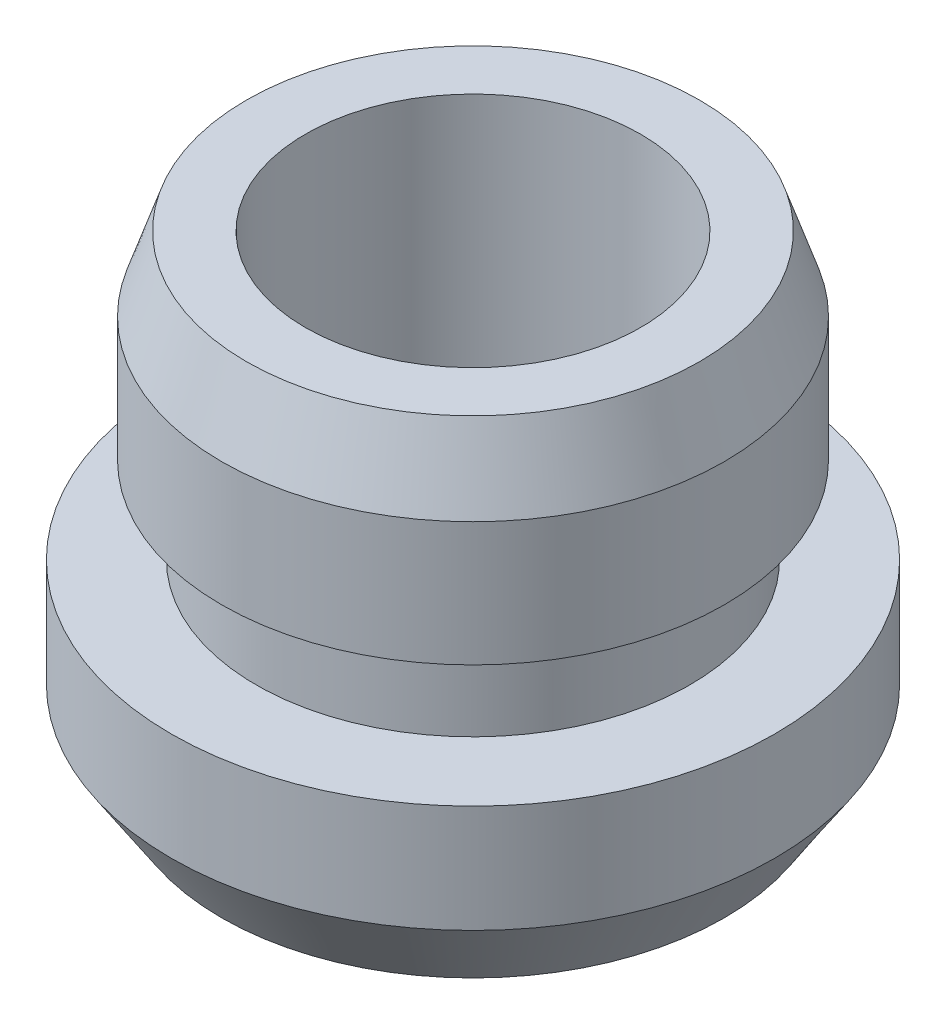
ISO-10303-21;
HEADER;
FILE_DESCRIPTION(('STEP AP214'),'2;1');
FILE_NAME('part.step','',(''),(''),'','','');
FILE_SCHEMA(('AUTOMOTIVE_DESIGN { 1 0 10303 214 1 1 1 1 }'));
ENDSEC;
DATA;
#1=APPLICATION_CONTEXT('core data for automotive mechanical design processes');
#2=APPLICATION_PROTOCOL_DEFINITION('international standard','automotive_design',2000,#1);
#3=PRODUCT_CONTEXT('',#1,'mechanical');
#4=PRODUCT('Part','Part','',(#3));
#5=PRODUCT_RELATED_PRODUCT_CATEGORY('part','',(#4));
#6=PRODUCT_DEFINITION_FORMATION('','',#4);
#7=PRODUCT_DEFINITION_CONTEXT('part definition',#1,'design');
#8=PRODUCT_DEFINITION('design','',#6,#7);
#9=PRODUCT_DEFINITION_SHAPE('','',#8);
#10=(LENGTH_UNIT() NAMED_UNIT(*) SI_UNIT(.MILLI.,.METRE.));
#11=(NAMED_UNIT(*) PLANE_ANGLE_UNIT() SI_UNIT($,.RADIAN.));
#12=(NAMED_UNIT(*) SI_UNIT($,.STERADIAN.) SOLID_ANGLE_UNIT());
#13=UNCERTAINTY_MEASURE_WITH_UNIT(LENGTH_MEASURE(1.E-05),#10,'distance_accuracy_value','');
#14=(GEOMETRIC_REPRESENTATION_CONTEXT(3) GLOBAL_UNCERTAINTY_ASSIGNED_CONTEXT((#13)) GLOBAL_UNIT_ASSIGNED_CONTEXT((#10,
#11,#12)) REPRESENTATION_CONTEXT('',''));
#15=CARTESIAN_POINT('',(0.,0.,0.));
#16=DIRECTION('',(0.,0.,1.));
#17=DIRECTION('',(1.,0.,0.));
#18=AXIS2_PLACEMENT_3D('',#15,#16,#17);
#19=CARTESIAN_POINT('',(0.,2.28857833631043,0.));
#20=DIRECTION('',(0.,1.,0.));
#21=DIRECTION('',(0.,0.,1.));
#22=AXIS2_PLACEMENT_3D('',#19,#20,#21);
#23=CONICAL_SURFACE('',#22,9.,0.580182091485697);
#24=CARTESIAN_POINT('',(0.,0.,0.));
#25=DIRECTION('',(0.,-1.,0.));
#26=DIRECTION('',(0.,0.,-1.));
#27=AXIS2_PLACEMENT_3D('',#24,#25,#26);
#28=CIRCLE('',#27,7.5);
#29=CARTESIAN_POINT('',(0.,0.,-7.5));
#30=VERTEX_POINT('',#29);
#31=EDGE_CURVE('E10',#30,#30,#28,.T.);
#32=ORIENTED_EDGE('',*,*,#31,.F.);
#33=EDGE_LOOP('',(#32));
#34=FACE_BOUND('',#33,.T.);
#35=CARTESIAN_POINT('',(0.,2.28857833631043,0.));
#36=DIRECTION('',(0.,-1.,0.));
#37=DIRECTION('',(0.,0.,-1.));
#38=AXIS2_PLACEMENT_3D('',#35,#36,#37);
#39=CIRCLE('',#38,9.);
#40=CARTESIAN_POINT('',(0.,2.28857833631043,-9.));
#41=VERTEX_POINT('',#40);
#42=EDGE_CURVE('E64',#41,#41,#39,.T.);
#43=ORIENTED_EDGE('',*,*,#42,.T.);
#44=EDGE_LOOP('',(#43));
#45=FACE_BOUND('',#44,.T.);
#46=ADVANCED_FACE('F30',(#34,#45),#23,.T.);
#47=CARTESIAN_POINT('',(-5.,0.,0.));
#48=DIRECTION('',(0.,1.,0.));
#49=DIRECTION('',(0.,0.,1.));
#50=AXIS2_PLACEMENT_3D('',#47,#48,#49);
#51=PLANE('',#50);
#52=CARTESIAN_POINT('',(0.,0.,0.));
#53=DIRECTION('',(0.,-1.,0.));
#54=DIRECTION('',(0.,0.,-1.));
#55=AXIS2_PLACEMENT_3D('',#52,#53,#54);
#56=CIRCLE('',#55,5.);
#57=CARTESIAN_POINT('',(0.,0.,-5.));
#58=VERTEX_POINT('',#57);
#59=EDGE_CURVE('E36',#58,#58,#56,.T.);
#60=ORIENTED_EDGE('',*,*,#59,.F.);
#61=EDGE_LOOP('',(#60));
#62=FACE_BOUND('',#61,.T.);
#63=ORIENTED_EDGE('',*,*,#31,.T.);
#64=EDGE_LOOP('',(#63));
#65=FACE_BOUND('',#64,.T.);
#66=ADVANCED_FACE('F113',(#62,#65),#51,.F.);
#67=CARTESIAN_POINT('',(0.,0.,0.));
#68=DIRECTION('',(0.,-1.,0.));
#69=DIRECTION('',(0.,0.,-1.));
#70=AXIS2_PLACEMENT_3D('',#67,#68,#69);
#71=CYLINDRICAL_SURFACE('',#70,5.);
#72=CARTESIAN_POINT('',(0.,14.,0.));
#73=DIRECTION('',(0.,-1.,0.));
#74=DIRECTION('',(0.,0.,-1.));
#75=AXIS2_PLACEMENT_3D('',#72,#73,#74);
#76=CIRCLE('',#75,5.);
#77=CARTESIAN_POINT('',(0.,14.,-5.));
#78=VERTEX_POINT('',#77);
#79=EDGE_CURVE('E40',#78,#78,#76,.T.);
#80=ORIENTED_EDGE('',*,*,#79,.F.);
#81=EDGE_LOOP('',(#80));
#82=FACE_BOUND('',#81,.T.);
#83=ORIENTED_EDGE('',*,*,#59,.T.);
#84=EDGE_LOOP('',(#83));
#85=FACE_BOUND('',#84,.T.);
#86=ADVANCED_FACE('F108',(#82,#85),#71,.F.);
#87=CARTESIAN_POINT('',(-6.76,14.,0.));
#88=DIRECTION('',(0.,-1.,0.));
#89=DIRECTION('',(0.,0.,-1.));
#90=AXIS2_PLACEMENT_3D('',#87,#88,#89);
#91=PLANE('',#90);
#92=CARTESIAN_POINT('',(0.,14.,0.));
#93=DIRECTION('',(0.,-1.,0.));
#94=DIRECTION('',(0.,0.,-1.));
#95=AXIS2_PLACEMENT_3D('',#92,#93,#94);
#96=CIRCLE('',#95,6.76);
#97=CARTESIAN_POINT('',(0.,14.,-6.76));
#98=VERTEX_POINT('',#97);
#99=EDGE_CURVE('E44',#98,#98,#96,.T.);
#100=ORIENTED_EDGE('',*,*,#99,.F.);
#101=EDGE_LOOP('',(#100));
#102=FACE_BOUND('',#101,.T.);
#103=ORIENTED_EDGE('',*,*,#79,.T.);
#104=EDGE_LOOP('',(#103));
#105=FACE_BOUND('',#104,.T.);
#106=ADVANCED_FACE('F102',(#102,#105),#91,.F.);
#107=CARTESIAN_POINT('',(0.,14.,0.));
#108=DIRECTION('',(0.,-1.,0.));
#109=DIRECTION('',(0.,0.,-1.));
#110=AXIS2_PLACEMENT_3D('',#107,#108,#109);
#111=CONICAL_SURFACE('',#110,6.76,0.322767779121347);
#112=CARTESIAN_POINT('',(0.,11.7875045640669,0.));
#113=DIRECTION('',(0.,-1.,0.));
#114=DIRECTION('',(0.,0.,-1.));
#115=AXIS2_PLACEMENT_3D('',#112,#113,#114);
#116=CIRCLE('',#115,7.5);
#117=CARTESIAN_POINT('',(0.,11.7875045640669,-7.5));
#118=VERTEX_POINT('',#117);
#119=EDGE_CURVE('E49',#118,#118,#116,.T.);
#120=ORIENTED_EDGE('',*,*,#119,.F.);
#121=EDGE_LOOP('',(#120));
#122=FACE_BOUND('',#121,.T.);
#123=ORIENTED_EDGE('',*,*,#99,.T.);
#124=EDGE_LOOP('',(#123));
#125=FACE_BOUND('',#124,.T.);
#126=ADVANCED_FACE('F96',(#122,#125),#111,.T.);
#127=CARTESIAN_POINT('',(0.,0.,0.));
#128=DIRECTION('',(0.,-1.,0.));
#129=DIRECTION('',(0.,0.,-1.));
#130=AXIS2_PLACEMENT_3D('',#127,#128,#129);
#131=CYLINDRICAL_SURFACE('',#130,7.5);
#132=CARTESIAN_POINT('',(0.,8.08798769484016,0.));
#133=DIRECTION('',(0.,-1.,0.));
#134=DIRECTION('',(0.,0.,-1.));
#135=AXIS2_PLACEMENT_3D('',#132,#133,#134);
#136=CIRCLE('',#135,7.5);
#137=CARTESIAN_POINT('',(0.,8.08798769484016,-7.5));
#138=VERTEX_POINT('',#137);
#139=EDGE_CURVE('E52',#138,#138,#136,.T.);
#140=ORIENTED_EDGE('',*,*,#139,.F.);
#141=EDGE_LOOP('',(#140));
#142=FACE_BOUND('',#141,.T.);
#143=ORIENTED_EDGE('',*,*,#119,.T.);
#144=EDGE_LOOP('',(#143));
#145=FACE_BOUND('',#144,.T.);
#146=ADVANCED_FACE('F90',(#142,#145),#131,.T.);
#147=CARTESIAN_POINT('',(0.,8.08798769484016,0.));
#148=DIRECTION('',(0.,1.,0.));
#149=DIRECTION('',(0.,0.,1.));
#150=AXIS2_PLACEMENT_3D('',#147,#148,#149);
#151=CONICAL_SURFACE('',#150,7.5,1.01914134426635);
#152=CARTESIAN_POINT('',(0.,7.45243598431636,0.));
#153=DIRECTION('',(0.,-1.,0.));
#154=DIRECTION('',(0.,0.,-1.));
#155=AXIS2_PLACEMENT_3D('',#152,#153,#154);
#156=CIRCLE('',#155,6.46722847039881);
#157=CARTESIAN_POINT('',(0.,7.45243598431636,-6.46722847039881));
#158=VERTEX_POINT('',#157);
#159=EDGE_CURVE('E55',#158,#158,#156,.T.);
#160=ORIENTED_EDGE('',*,*,#159,.F.);
#161=EDGE_LOOP('',(#160));
#162=FACE_BOUND('',#161,.T.);
#163=ORIENTED_EDGE('',*,*,#139,.T.);
#164=EDGE_LOOP('',(#163));
#165=FACE_BOUND('',#164,.T.);
#166=ADVANCED_FACE('F84',(#162,#165),#151,.T.);
#167=CARTESIAN_POINT('',(0.,0.,0.));
#168=DIRECTION('',(0.,-1.,0.));
#169=DIRECTION('',(0.,0.,-1.));
#170=AXIS2_PLACEMENT_3D('',#167,#168,#169);
#171=CYLINDRICAL_SURFACE('',#170,6.46722847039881);
#172=CARTESIAN_POINT('',(0.,5.5,0.));
#173=DIRECTION('',(0.,-1.,0.));
#174=DIRECTION('',(0.,0.,-1.));
#175=AXIS2_PLACEMENT_3D('',#172,#173,#174);
#176=CIRCLE('',#175,6.46722847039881);
#177=CARTESIAN_POINT('',(0.,5.5,-6.46722847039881));
#178=VERTEX_POINT('',#177);
#179=EDGE_CURVE('E58',#178,#178,#176,.T.);
#180=ORIENTED_EDGE('',*,*,#179,.F.);
#181=EDGE_LOOP('',(#180));
#182=FACE_BOUND('',#181,.T.);
#183=ORIENTED_EDGE('',*,*,#159,.T.);
#184=EDGE_LOOP('',(#183));
#185=FACE_BOUND('',#184,.T.);
#186=ADVANCED_FACE('F78',(#182,#185),#171,.T.);
#187=CARTESIAN_POINT('',(-9.,5.5,0.));
#188=DIRECTION('',(0.,-1.,0.));
#189=DIRECTION('',(0.,0.,-1.));
#190=AXIS2_PLACEMENT_3D('',#187,#188,#189);
#191=PLANE('',#190);
#192=CARTESIAN_POINT('',(0.,5.5,0.));
#193=DIRECTION('',(0.,-1.,0.));
#194=DIRECTION('',(0.,0.,-1.));
#195=AXIS2_PLACEMENT_3D('',#192,#193,#194);
#196=CIRCLE('',#195,9.);
#197=CARTESIAN_POINT('',(0.,5.5,-9.));
#198=VERTEX_POINT('',#197);
#199=EDGE_CURVE('E61',#198,#198,#196,.T.);
#200=ORIENTED_EDGE('',*,*,#199,.F.);
#201=EDGE_LOOP('',(#200));
#202=FACE_BOUND('',#201,.T.);
#203=ORIENTED_EDGE('',*,*,#179,.T.);
#204=EDGE_LOOP('',(#203));
#205=FACE_BOUND('',#204,.T.);
#206=ADVANCED_FACE('F72',(#202,#205),#191,.F.);
#207=CARTESIAN_POINT('',(0.,0.,0.));
#208=DIRECTION('',(0.,-1.,0.));
#209=DIRECTION('',(0.,0.,-1.));
#210=AXIS2_PLACEMENT_3D('',#207,#208,#209);
#211=CYLINDRICAL_SURFACE('',#210,9.);
#212=ORIENTED_EDGE('',*,*,#42,.F.);
#213=EDGE_LOOP('',(#212));
#214=FACE_BOUND('',#213,.T.);
#215=ORIENTED_EDGE('',*,*,#199,.T.);
#216=EDGE_LOOP('',(#215));
#217=FACE_BOUND('',#216,.T.);
#218=ADVANCED_FACE('F69',(#214,#217),#211,.T.);
#219=CLOSED_SHELL('',(#46,#66,#86,#106,#126,#146,#166,#186,#206,#218));
#220=MANIFOLD_SOLID_BREP('B2',#219);
#221=ADVANCED_BREP_SHAPE_REPRESENTATION('',(#18,#220),#14);
#222=SHAPE_DEFINITION_REPRESENTATION(#9,#221);
ENDSEC;
END-ISO-10303-21;
